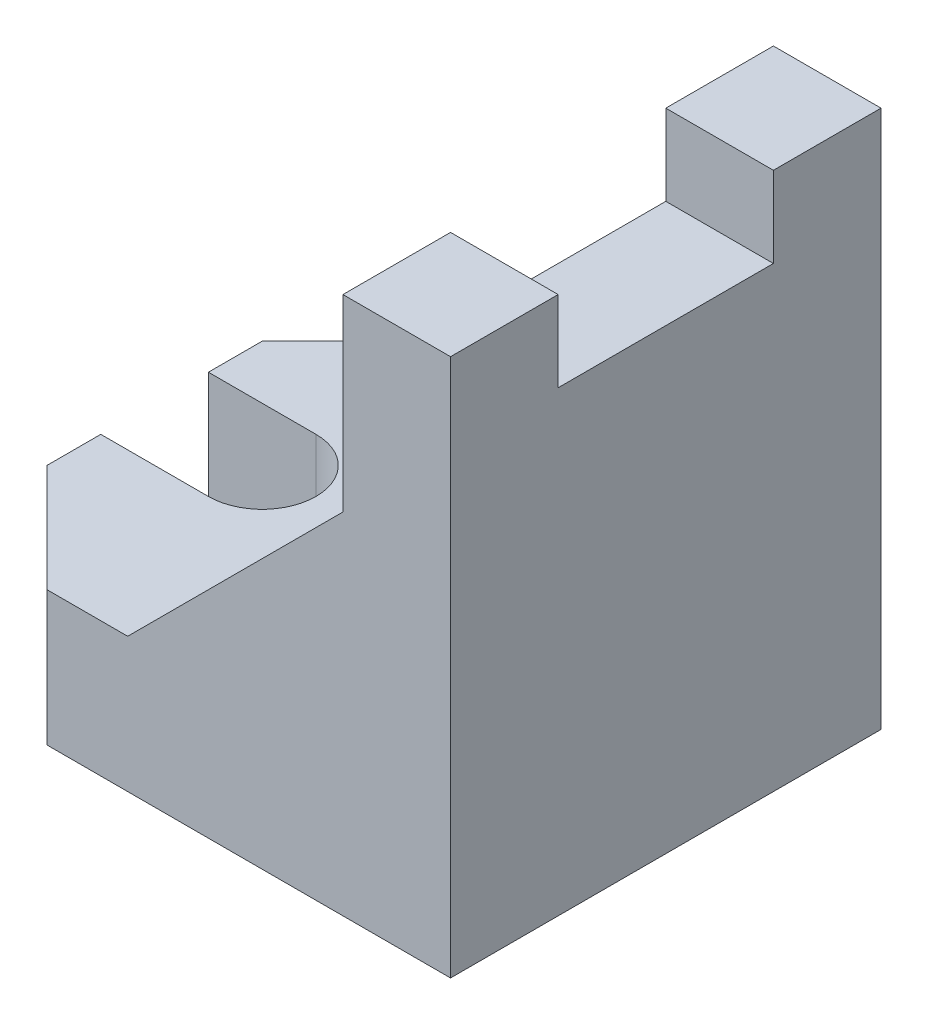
from build123d import *

# Parameters (mm, degrees)
EXTRUDE_1_DEPTH     = 40
CHAMFER_1_SIZE      = 20
CUT_EXTRUDE_1_DEPTH = 128.47548784
CUT_EXTRUDE_2_DEPTH = 20
SKETCH_4_W          = 40
SKETCH_4_H          = 15
CUT_EXTRUDE_3_DEPTH = 132.244047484


with BuildPart() as part:
    # Sketch 1 → Extrude 1 (new, symmetric)
    with BuildSketch(Plane.XY):
        Polygon((0, 0), (95, 0), (95, 100), (75, 100), (75, 65), (35, 25), (0, 25), align=None)
    extrude(amount=EXTRUDE_1_DEPTH, both=True)

    # Chamfer 1
    chamfer_1_edges = [part.edges().sort_by_distance(p)[0] for p in [
        (0, 12.5, 40),
        (0, 12.5, -40),
    ]]
    chamfer(chamfer_1_edges, length=CHAMFER_1_SIZE)

    # Sketch 2 → Cut-Extrude 1 (cut, through all)
    with BuildSketch(Plane(origin=(0, 25, 0), x_dir=(1, 0, 0), z_dir=(0, 1, 0))):
        with BuildLine():
            Line((0, -10), (20, -10))
            ThreePointArc((20, -10), (30, 0), (20, 10))
            Line((20, 10), (0, 10))
            ThreePointArc((0, 10), (-10, 0), (0, -10))
        make_face()
    extrude(amount=-CUT_EXTRUDE_1_DEPTH, mode=Mode.SUBTRACT)

    # Sketch 3 → Cut-Extrude 2 (cut, symmetric)
    with BuildSketch(Plane.XY):
        Polygon((35, 25), (75, 65), (75, 25), align=None)
    extrude(amount=CUT_EXTRUDE_2_DEPTH, both=True, mode=Mode.SUBTRACT)

    # Sketch 4 → Cut-Extrude 3 (cut, through all)
    with BuildSketch(Plane.ZY.offset(-75)):
        with Locations((0, 92.5)):
            Rectangle(SKETCH_4_W, SKETCH_4_H)
    extrude(amount=-CUT_EXTRUDE_3_DEPTH, mode=Mode.SUBTRACT)


solid = part.part
